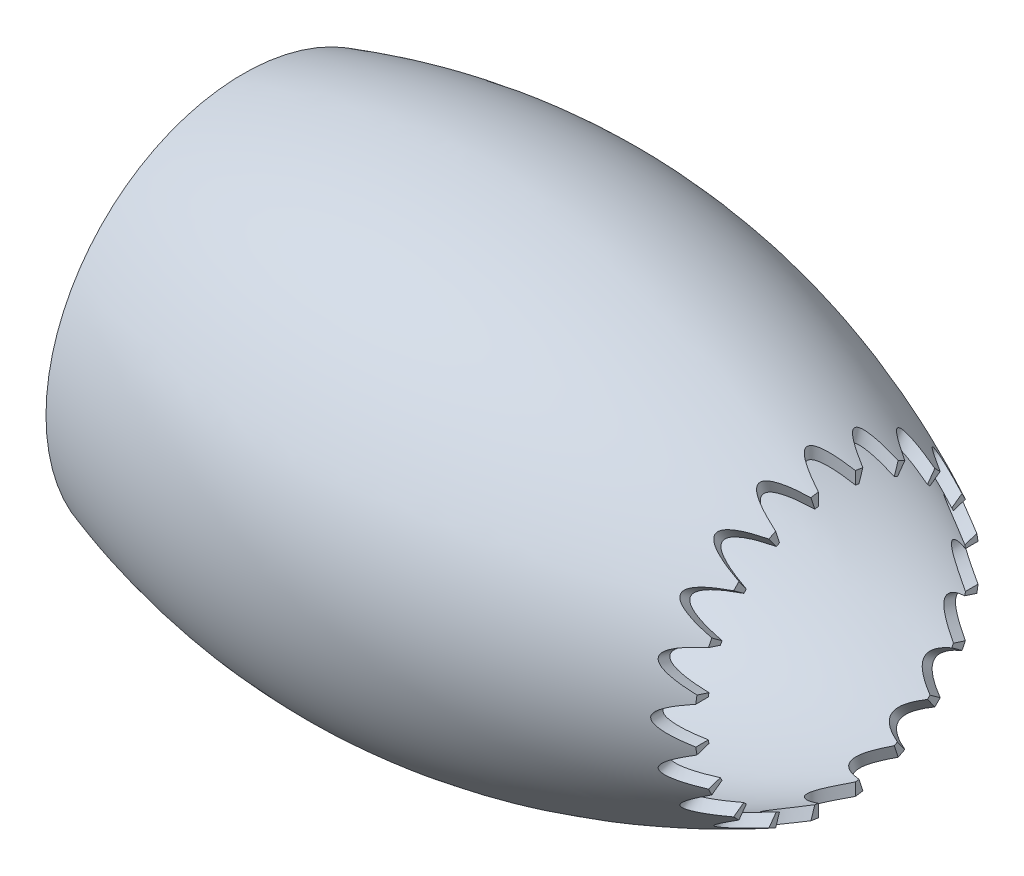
from build123d import *

# Parameters (mm, degrees)
SHELL6_T           = 76.2
CUT_EXTRUDE3_START = -254
CUT_EXTRUDE3_DEPTH = 5346.290453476
CIRPATTERN1_COUNT  = 20


with BuildPart() as part:
    # Sketch2 → Revolve4 (revolve)
    with BuildSketch(Plane.XY):
        with BuildLine():
            Line((0, 0), (4064, 0))
            Line((4064, 0), (4064, 889))
            add(Edge.make_bspline(
                [(0, 1270), (2011.283529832, 1925.609262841), (4064, 889)],
                knots=[0, 0, 0, 1, 1, 1], degree=2))
            Line((0, 1270), (0, 0))
        make_face()
    revolve(axis=Axis((0, 0, 0), (1, 0, 0)))

    # Shell6
    shell6_openings = [part.faces().sort_by_distance(p)[0] for p in [
        (4064, 0, 0),
        (0, 0, 0),
    ]]
    offset(amount=SHELL6_T, openings=shell6_openings, kind=Kind.INTERSECTION)

    # Sketch4 → Cut-Extrude3 (cut)
    with BuildSketch(Plane.XY.offset(1016).offset(CUT_EXTRUDE3_START)):
        with BuildLine():
            Line((4064, 127), (4064, -127))
            add(Edge.make_bspline(
                [(4064, 127), (3657.6, 0), (4064, -127)],
                knots=[0, 0, 0, 1, 1, 1], degree=2))
        make_face()
    cut_extrude3 = extrude(amount=CUT_EXTRUDE3_DEPTH, mode=Mode.SUBTRACT)

    # CirPattern1: Cut-Extrude3 ×20 about axis
    cirpattern1_axis = Axis((0, 0, 0), (1, 0, 0))
    for i in range(1, CIRPATTERN1_COUNT):
        add(cut_extrude3.rotate(cirpattern1_axis, i * 360 / CIRPATTERN1_COUNT), mode=Mode.SUBTRACT)


solid = part.part
